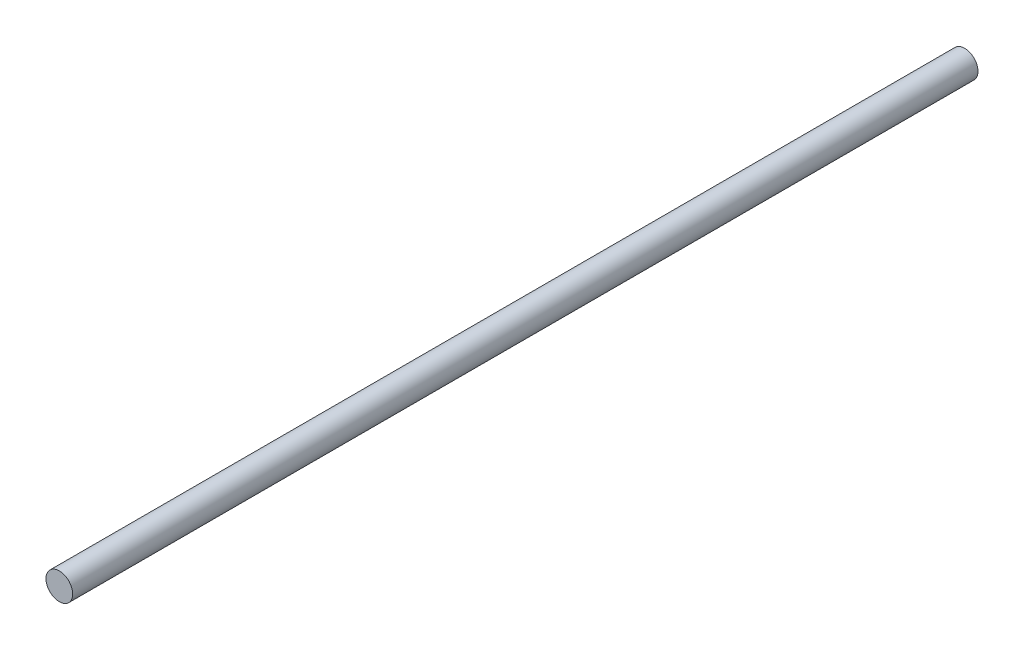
ISO-10303-21;
HEADER;
FILE_DESCRIPTION(('STEP AP214'),'2;1');
FILE_NAME('part.step','',(''),(''),'','','');
FILE_SCHEMA(('AUTOMOTIVE_DESIGN { 1 0 10303 214 1 1 1 1 }'));
ENDSEC;
DATA;
#1=APPLICATION_CONTEXT('core data for automotive mechanical design processes');
#2=APPLICATION_PROTOCOL_DEFINITION('international standard','automotive_design',2000,#1);
#3=PRODUCT_CONTEXT('',#1,'mechanical');
#4=PRODUCT('Part','Part','',(#3));
#5=PRODUCT_RELATED_PRODUCT_CATEGORY('part','',(#4));
#6=PRODUCT_DEFINITION_FORMATION('','',#4);
#7=PRODUCT_DEFINITION_CONTEXT('part definition',#1,'design');
#8=PRODUCT_DEFINITION('design','',#6,#7);
#9=PRODUCT_DEFINITION_SHAPE('','',#8);
#10=(LENGTH_UNIT() NAMED_UNIT(*) SI_UNIT(.MILLI.,.METRE.));
#11=(NAMED_UNIT(*) PLANE_ANGLE_UNIT() SI_UNIT($,.RADIAN.));
#12=(NAMED_UNIT(*) SI_UNIT($,.STERADIAN.) SOLID_ANGLE_UNIT());
#13=UNCERTAINTY_MEASURE_WITH_UNIT(LENGTH_MEASURE(1.E-05),#10,'distance_accuracy_value','');
#14=(GEOMETRIC_REPRESENTATION_CONTEXT(3) GLOBAL_UNCERTAINTY_ASSIGNED_CONTEXT((#13)) GLOBAL_UNIT_ASSIGNED_CONTEXT((#10,
#11,#12)) REPRESENTATION_CONTEXT('',''));
#15=CARTESIAN_POINT('',(0.,0.,0.));
#16=DIRECTION('',(0.,0.,1.));
#17=DIRECTION('',(1.,0.,0.));
#18=AXIS2_PLACEMENT_3D('',#15,#16,#17);
#19=CARTESIAN_POINT('',(0.,0.,-196.));
#20=DIRECTION('',(0.,0.,1.));
#21=DIRECTION('',(1.,0.,0.));
#22=AXIS2_PLACEMENT_3D('',#19,#20,#21);
#23=CYLINDRICAL_SURFACE('',#22,2.95);
#24=CARTESIAN_POINT('',(0.,0.,-196.));
#25=DIRECTION('',(0.,0.,1.));
#26=DIRECTION('',(1.,0.,0.));
#27=AXIS2_PLACEMENT_3D('',#24,#25,#26);
#28=CIRCLE('',#27,2.95);
#29=CARTESIAN_POINT('',(2.95,0.,-196.));
#30=VERTEX_POINT('',#29);
#31=EDGE_CURVE('E10',#30,#30,#28,.T.);
#32=ORIENTED_EDGE('',*,*,#31,.T.);
#33=EDGE_LOOP('',(#32));
#34=FACE_BOUND('',#33,.T.);
#35=CARTESIAN_POINT('',(0.,0.,4.));
#36=DIRECTION('',(0.,0.,1.));
#37=DIRECTION('',(1.,0.,0.));
#38=AXIS2_PLACEMENT_3D('',#35,#36,#37);
#39=CIRCLE('',#38,2.95);
#40=CARTESIAN_POINT('',(2.95,0.,4.));
#41=VERTEX_POINT('',#40);
#42=EDGE_CURVE('E45',#41,#41,#39,.T.);
#43=ORIENTED_EDGE('',*,*,#42,.F.);
#44=EDGE_LOOP('',(#43));
#45=FACE_BOUND('',#44,.T.);
#46=ADVANCED_FACE('F39',(#34,#45),#23,.T.);
#47=CARTESIAN_POINT('',(0.,0.,-196.));
#48=DIRECTION('',(0.,0.,1.));
#49=DIRECTION('',(1.,0.,0.));
#50=AXIS2_PLACEMENT_3D('',#47,#48,#49);
#51=PLANE('',#50);
#52=ORIENTED_EDGE('',*,*,#31,.F.);
#53=EDGE_LOOP('',(#52));
#54=FACE_BOUND('',#53,.T.);
#55=ADVANCED_FACE('F54',(#54),#51,.F.);
#56=CARTESIAN_POINT('',(0.,0.,4.));
#57=DIRECTION('',(0.,0.,1.));
#58=DIRECTION('',(1.,0.,0.));
#59=AXIS2_PLACEMENT_3D('',#56,#57,#58);
#60=PLANE('',#59);
#61=ORIENTED_EDGE('',*,*,#42,.T.);
#62=EDGE_LOOP('',(#61));
#63=FACE_BOUND('',#62,.T.);
#64=ADVANCED_FACE('F51',(#63),#60,.T.);
#65=CLOSED_SHELL('',(#46,#55,#64));
#66=MANIFOLD_SOLID_BREP('B2',#65);
#67=ADVANCED_BREP_SHAPE_REPRESENTATION('',(#18,#66),#14);
#68=SHAPE_DEFINITION_REPRESENTATION(#9,#67);
ENDSEC;
END-ISO-10303-21;
